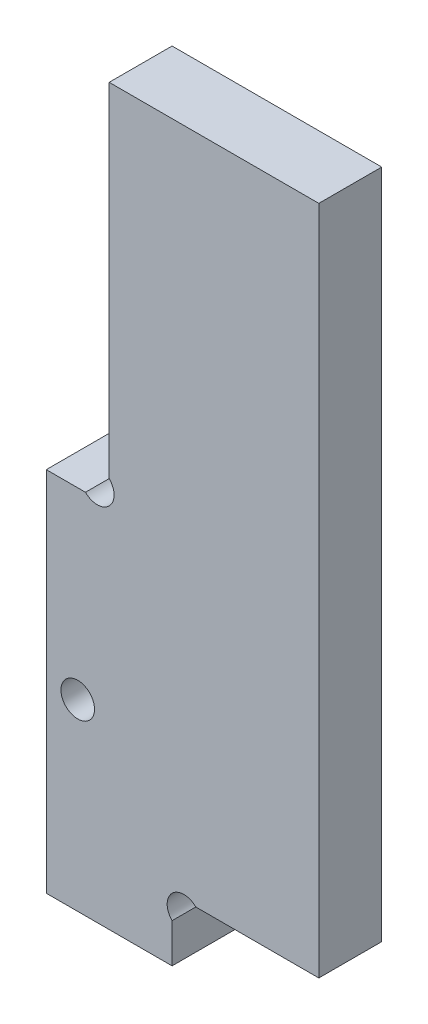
ISO-10303-21;
HEADER;
FILE_DESCRIPTION(('STEP AP214'),'2;1');
FILE_NAME('part.step','',(''),(''),'','','');
FILE_SCHEMA(('AUTOMOTIVE_DESIGN { 1 0 10303 214 1 1 1 1 }'));
ENDSEC;
DATA;
#1=APPLICATION_CONTEXT('core data for automotive mechanical design processes');
#2=APPLICATION_PROTOCOL_DEFINITION('international standard','automotive_design',2000,#1);
#3=PRODUCT_CONTEXT('',#1,'mechanical');
#4=PRODUCT('Part','Part','',(#3));
#5=PRODUCT_RELATED_PRODUCT_CATEGORY('part','',(#4));
#6=PRODUCT_DEFINITION_FORMATION('','',#4);
#7=PRODUCT_DEFINITION_CONTEXT('part definition',#1,'design');
#8=PRODUCT_DEFINITION('design','',#6,#7);
#9=PRODUCT_DEFINITION_SHAPE('','',#8);
#10=(LENGTH_UNIT() NAMED_UNIT(*) SI_UNIT(.MILLI.,.METRE.));
#11=(NAMED_UNIT(*) PLANE_ANGLE_UNIT() SI_UNIT($,.RADIAN.));
#12=(NAMED_UNIT(*) SI_UNIT($,.STERADIAN.) SOLID_ANGLE_UNIT());
#13=UNCERTAINTY_MEASURE_WITH_UNIT(LENGTH_MEASURE(1.E-05),#10,'distance_accuracy_value','');
#14=(GEOMETRIC_REPRESENTATION_CONTEXT(3) GLOBAL_UNCERTAINTY_ASSIGNED_CONTEXT((#13)) GLOBAL_UNIT_ASSIGNED_CONTEXT((#10,
#11,#12)) REPRESENTATION_CONTEXT('',''));
#15=CARTESIAN_POINT('',(0.,0.,0.));
#16=DIRECTION('',(0.,0.,1.));
#17=DIRECTION('',(1.,0.,0.));
#18=AXIS2_PLACEMENT_3D('',#15,#16,#17);
#19=CARTESIAN_POINT('',(13.1313708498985,4.86862915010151,6.));
#20=DIRECTION('',(0.,0.,1.));
#21=DIRECTION('',(1.,0.,0.));
#22=AXIS2_PLACEMENT_3D('',#19,#20,#21);
#23=PLANE('',#22);
#24=CARTESIAN_POINT('',(13.1313708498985,4.86862915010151,6.));
#25=DIRECTION('',(0.,0.,-1.));
#26=DIRECTION('',(1.,0.,0.));
#27=AXIS2_PLACEMENT_3D('',#24,#25,#26);
#28=CIRCLE('',#27,1.60000000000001);
#29=CARTESIAN_POINT('',(12.,3.73725830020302,6.));
#30=VERTEX_POINT('',#29);
#31=CARTESIAN_POINT('',(14.262741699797,6.,6.));
#32=VERTEX_POINT('',#31);
#33=EDGE_CURVE('E165',#30,#32,#28,.T.);
#34=ORIENTED_EDGE('',*,*,#33,.T.);
#35=DIRECTION('',(1.,0.,0.));
#36=VECTOR('',#35,1.);
#37=CARTESIAN_POINT('',(14.262741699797,6.,6.));
#38=LINE('',#37,#36);
#39=CARTESIAN_POINT('',(26.,6.,6.));
#40=VERTEX_POINT('',#39);
#41=EDGE_CURVE('E103',#32,#40,#38,.T.);
#42=ORIENTED_EDGE('',*,*,#41,.T.);
#43=DIRECTION('',(0.,1.,0.));
#44=VECTOR('',#43,1.);
#45=CARTESIAN_POINT('',(26.,6.,6.));
#46=LINE('',#45,#44);
#47=CARTESIAN_POINT('',(26.,70.,6.));
#48=VERTEX_POINT('',#47);
#49=EDGE_CURVE('E186',#40,#48,#46,.T.);
#50=ORIENTED_EDGE('',*,*,#49,.T.);
#51=DIRECTION('',(-1.,0.,0.));
#52=VECTOR('',#51,1.);
#53=CARTESIAN_POINT('',(26.,70.,6.));
#54=LINE('',#53,#52);
#55=CARTESIAN_POINT('',(6.,70.,6.));
#56=VERTEX_POINT('',#55);
#57=EDGE_CURVE('E205',#48,#56,#54,.T.);
#58=ORIENTED_EDGE('',*,*,#57,.T.);
#59=DIRECTION('',(0.,-1.,0.));
#60=VECTOR('',#59,1.);
#61=CARTESIAN_POINT('',(6.,70.,6.));
#62=LINE('',#61,#60);
#63=CARTESIAN_POINT('',(6.00000000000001,37.2627416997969,6.));
#64=VERTEX_POINT('',#63);
#65=EDGE_CURVE('E202',#56,#64,#62,.T.);
#66=ORIENTED_EDGE('',*,*,#65,.T.);
#67=CARTESIAN_POINT('',(4.86862915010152,36.1313708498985,6.));
#68=DIRECTION('',(0.,0.,-1.));
#69=DIRECTION('',(1.,0.,0.));
#70=AXIS2_PLACEMENT_3D('',#67,#68,#69);
#71=CIRCLE('',#70,1.6);
#72=CARTESIAN_POINT('',(3.73725830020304,35.,6.));
#73=VERTEX_POINT('',#72);
#74=EDGE_CURVE('E204',#64,#73,#71,.T.);
#75=ORIENTED_EDGE('',*,*,#74,.T.);
#76=DIRECTION('',(-1.,0.,0.));
#77=VECTOR('',#76,1.);
#78=CARTESIAN_POINT('',(0.,35.,6.));
#79=LINE('',#78,#77);
#80=CARTESIAN_POINT('',(0.,35.,6.));
#81=VERTEX_POINT('',#80);
#82=EDGE_CURVE('E128',#73,#81,#79,.T.);
#83=ORIENTED_EDGE('',*,*,#82,.T.);
#84=DIRECTION('',(0.,-1.,0.));
#85=VECTOR('',#84,1.);
#86=CARTESIAN_POINT('',(0.,0.,6.));
#87=LINE('',#86,#85);
#88=CARTESIAN_POINT('',(0.,0.,6.));
#89=VERTEX_POINT('',#88);
#90=EDGE_CURVE('E122',#81,#89,#87,.T.);
#91=ORIENTED_EDGE('',*,*,#90,.T.);
#92=DIRECTION('',(1.,0.,0.));
#93=VECTOR('',#92,1.);
#94=CARTESIAN_POINT('',(12.,0.,6.));
#95=LINE('',#94,#93);
#96=CARTESIAN_POINT('',(12.,0.,6.));
#97=VERTEX_POINT('',#96);
#98=EDGE_CURVE('E126',#89,#97,#95,.T.);
#99=ORIENTED_EDGE('',*,*,#98,.T.);
#100=DIRECTION('',(0.,1.,0.));
#101=VECTOR('',#100,1.);
#102=CARTESIAN_POINT('',(12.,3.73725830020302,6.));
#103=LINE('',#102,#101);
#104=EDGE_CURVE('E54',#97,#30,#103,.T.);
#105=ORIENTED_EDGE('',*,*,#104,.T.);
#106=EDGE_LOOP('',(#34,#42,#50,#58,#66,#75,#83,#91,#99,#105));
#107=FACE_BOUND('',#106,.T.);
#108=CARTESIAN_POINT('',(3.,17.5,6.));
#109=DIRECTION('',(0.,0.,1.));
#110=DIRECTION('',(1.,0.,0.));
#111=AXIS2_PLACEMENT_3D('',#108,#109,#110);
#112=CIRCLE('',#111,1.6);
#113=CARTESIAN_POINT('',(4.6,17.5,6.));
#114=VERTEX_POINT('',#113);
#115=EDGE_CURVE('E150',#114,#114,#112,.T.);
#116=ORIENTED_EDGE('',*,*,#115,.F.);
#117=EDGE_LOOP('',(#116));
#118=FACE_BOUND('',#117,.T.);
#119=ADVANCED_FACE('F37',(#107,#118),#23,.T.);
#120=CARTESIAN_POINT('',(13.1313708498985,4.86862915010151,0.));
#121=DIRECTION('',(0.,0.,1.));
#122=DIRECTION('',(1.,0.,0.));
#123=AXIS2_PLACEMENT_3D('',#120,#121,#122);
#124=PLANE('',#123);
#125=CARTESIAN_POINT('',(13.1313708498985,4.86862915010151,0.));
#126=DIRECTION('',(0.,0.,-1.));
#127=DIRECTION('',(1.,0.,0.));
#128=AXIS2_PLACEMENT_3D('',#125,#126,#127);
#129=CIRCLE('',#128,1.60000000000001);
#130=CARTESIAN_POINT('',(12.,3.73725830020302,0.));
#131=VERTEX_POINT('',#130);
#132=CARTESIAN_POINT('',(14.262741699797,6.,0.));
#133=VERTEX_POINT('',#132);
#134=EDGE_CURVE('E146',#131,#133,#129,.T.);
#135=ORIENTED_EDGE('',*,*,#134,.F.);
#136=DIRECTION('',(0.,1.,0.));
#137=VECTOR('',#136,1.);
#138=CARTESIAN_POINT('',(12.,3.73725830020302,0.));
#139=LINE('',#138,#137);
#140=CARTESIAN_POINT('',(12.,0.,0.));
#141=VERTEX_POINT('',#140);
#142=EDGE_CURVE('E95',#141,#131,#139,.T.);
#143=ORIENTED_EDGE('',*,*,#142,.F.);
#144=DIRECTION('',(1.,0.,0.));
#145=VECTOR('',#144,1.);
#146=CARTESIAN_POINT('',(12.,0.,0.));
#147=LINE('',#146,#145);
#148=CARTESIAN_POINT('',(0.,0.,0.));
#149=VERTEX_POINT('',#148);
#150=EDGE_CURVE('E89',#149,#141,#147,.T.);
#151=ORIENTED_EDGE('',*,*,#150,.F.);
#152=DIRECTION('',(0.,-1.,0.));
#153=VECTOR('',#152,1.);
#154=CARTESIAN_POINT('',(0.,0.,0.));
#155=LINE('',#154,#153);
#156=CARTESIAN_POINT('',(0.,35.,0.));
#157=VERTEX_POINT('',#156);
#158=EDGE_CURVE('E136',#157,#149,#155,.T.);
#159=ORIENTED_EDGE('',*,*,#158,.F.);
#160=DIRECTION('',(-1.,0.,0.));
#161=VECTOR('',#160,1.);
#162=CARTESIAN_POINT('',(0.,35.,0.));
#163=LINE('',#162,#161);
#164=CARTESIAN_POINT('',(3.73725830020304,35.,0.));
#165=VERTEX_POINT('',#164);
#166=EDGE_CURVE('E160',#165,#157,#163,.T.);
#167=ORIENTED_EDGE('',*,*,#166,.F.);
#168=CARTESIAN_POINT('',(4.86862915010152,36.1313708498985,0.));
#169=DIRECTION('',(0.,0.,-1.));
#170=DIRECTION('',(1.,0.,0.));
#171=AXIS2_PLACEMENT_3D('',#168,#169,#170);
#172=CIRCLE('',#171,1.6);
#173=CARTESIAN_POINT('',(6.00000000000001,37.2627416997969,0.));
#174=VERTEX_POINT('',#173);
#175=EDGE_CURVE('E158',#174,#165,#172,.T.);
#176=ORIENTED_EDGE('',*,*,#175,.F.);
#177=DIRECTION('',(0.,-1.,0.));
#178=VECTOR('',#177,1.);
#179=CARTESIAN_POINT('',(6.,70.,0.));
#180=LINE('',#179,#178);
#181=CARTESIAN_POINT('',(6.,70.,0.));
#182=VERTEX_POINT('',#181);
#183=EDGE_CURVE('E156',#182,#174,#180,.T.);
#184=ORIENTED_EDGE('',*,*,#183,.F.);
#185=DIRECTION('',(-1.,0.,0.));
#186=VECTOR('',#185,1.);
#187=CARTESIAN_POINT('',(26.,70.,0.));
#188=LINE('',#187,#186);
#189=CARTESIAN_POINT('',(26.,70.,0.));
#190=VERTEX_POINT('',#189);
#191=EDGE_CURVE('E154',#190,#182,#188,.T.);
#192=ORIENTED_EDGE('',*,*,#191,.F.);
#193=DIRECTION('',(0.,1.,0.));
#194=VECTOR('',#193,1.);
#195=CARTESIAN_POINT('',(26.,6.,0.));
#196=LINE('',#195,#194);
#197=CARTESIAN_POINT('',(26.,6.,0.));
#198=VERTEX_POINT('',#197);
#199=EDGE_CURVE('E152',#198,#190,#196,.T.);
#200=ORIENTED_EDGE('',*,*,#199,.F.);
#201=DIRECTION('',(1.,0.,0.));
#202=VECTOR('',#201,1.);
#203=CARTESIAN_POINT('',(14.262741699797,6.,0.));
#204=LINE('',#203,#202);
#205=EDGE_CURVE('E149',#133,#198,#204,.T.);
#206=ORIENTED_EDGE('',*,*,#205,.F.);
#207=EDGE_LOOP('',(#135,#143,#151,#159,#167,#176,#184,#192,#200,#206));
#208=FACE_BOUND('',#207,.T.);
#209=CARTESIAN_POINT('',(3.,17.5,0.));
#210=DIRECTION('',(0.,0.,1.));
#211=DIRECTION('',(1.,0.,0.));
#212=AXIS2_PLACEMENT_3D('',#209,#210,#211);
#213=CIRCLE('',#212,1.6);
#214=CARTESIAN_POINT('',(4.6,17.5,0.));
#215=VERTEX_POINT('',#214);
#216=EDGE_CURVE('E213',#215,#215,#213,.T.);
#217=ORIENTED_EDGE('',*,*,#216,.T.);
#218=EDGE_LOOP('',(#217));
#219=FACE_BOUND('',#218,.T.);
#220=ADVANCED_FACE('F190',(#208,#219),#124,.F.);
#221=CARTESIAN_POINT('',(13.1313708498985,4.86862915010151,6.));
#222=DIRECTION('',(0.,0.,-1.));
#223=DIRECTION('',(-1.,0.,0.));
#224=AXIS2_PLACEMENT_3D('',#221,#222,#223);
#225=CYLINDRICAL_SURFACE('',#224,1.60000000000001);
#226=ORIENTED_EDGE('',*,*,#134,.T.);
#227=DIRECTION('',(0.,0.,-1.));
#228=VECTOR('',#227,1.);
#229=CARTESIAN_POINT('',(14.262741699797,6.,6.));
#230=LINE('',#229,#228);
#231=EDGE_CURVE('E11',#32,#133,#230,.T.);
#232=ORIENTED_EDGE('',*,*,#231,.F.);
#233=ORIENTED_EDGE('',*,*,#33,.F.);
#234=DIRECTION('',(0.,0.,-1.));
#235=VECTOR('',#234,1.);
#236=CARTESIAN_POINT('',(12.,3.73725830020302,6.));
#237=LINE('',#236,#235);
#238=EDGE_CURVE('E142',#30,#131,#237,.T.);
#239=ORIENTED_EDGE('',*,*,#238,.T.);
#240=EDGE_LOOP('',(#226,#232,#233,#239));
#241=FACE_BOUND('',#240,.T.);
#242=ADVANCED_FACE('F39',(#241),#225,.F.);
#243=CARTESIAN_POINT('',(14.262741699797,6.,6.));
#244=DIRECTION('',(0.,1.,0.));
#245=DIRECTION('',(-1.,0.,0.));
#246=AXIS2_PLACEMENT_3D('',#243,#244,#245);
#247=PLANE('',#246);
#248=ORIENTED_EDGE('',*,*,#205,.T.);
#249=DIRECTION('',(0.,0.,-1.));
#250=VECTOR('',#249,1.);
#251=CARTESIAN_POINT('',(26.,6.,6.));
#252=LINE('',#251,#250);
#253=EDGE_CURVE('E46',#40,#198,#252,.T.);
#254=ORIENTED_EDGE('',*,*,#253,.F.);
#255=ORIENTED_EDGE('',*,*,#41,.F.);
#256=ORIENTED_EDGE('',*,*,#231,.T.);
#257=EDGE_LOOP('',(#248,#254,#255,#256));
#258=FACE_BOUND('',#257,.T.);
#259=ADVANCED_FACE('F249',(#258),#247,.F.);
#260=CARTESIAN_POINT('',(26.,6.,6.));
#261=DIRECTION('',(-1.,0.,0.));
#262=DIRECTION('',(0.,-1.,0.));
#263=AXIS2_PLACEMENT_3D('',#260,#261,#262);
#264=PLANE('',#263);
#265=ORIENTED_EDGE('',*,*,#199,.T.);
#266=DIRECTION('',(0.,0.,-1.));
#267=VECTOR('',#266,1.);
#268=CARTESIAN_POINT('',(26.,70.,6.));
#269=LINE('',#268,#267);
#270=EDGE_CURVE('E178',#48,#190,#269,.T.);
#271=ORIENTED_EDGE('',*,*,#270,.F.);
#272=ORIENTED_EDGE('',*,*,#49,.F.);
#273=ORIENTED_EDGE('',*,*,#253,.T.);
#274=EDGE_LOOP('',(#265,#271,#272,#273));
#275=FACE_BOUND('',#274,.T.);
#276=ADVANCED_FACE('F184',(#275),#264,.F.);
#277=CARTESIAN_POINT('',(26.,70.,6.));
#278=DIRECTION('',(0.,-1.,0.));
#279=DIRECTION('',(0.,0.,-1.));
#280=AXIS2_PLACEMENT_3D('',#277,#278,#279);
#281=PLANE('',#280);
#282=ORIENTED_EDGE('',*,*,#191,.T.);
#283=DIRECTION('',(0.,0.,-1.));
#284=VECTOR('',#283,1.);
#285=CARTESIAN_POINT('',(6.,70.,6.));
#286=LINE('',#285,#284);
#287=EDGE_CURVE('E175',#56,#182,#286,.T.);
#288=ORIENTED_EDGE('',*,*,#287,.F.);
#289=ORIENTED_EDGE('',*,*,#57,.F.);
#290=ORIENTED_EDGE('',*,*,#270,.T.);
#291=EDGE_LOOP('',(#282,#288,#289,#290));
#292=FACE_BOUND('',#291,.T.);
#293=ADVANCED_FACE('F196',(#292),#281,.F.);
#294=CARTESIAN_POINT('',(6.,70.,6.));
#295=DIRECTION('',(1.,0.,0.));
#296=DIRECTION('',(0.,1.,0.));
#297=AXIS2_PLACEMENT_3D('',#294,#295,#296);
#298=PLANE('',#297);
#299=ORIENTED_EDGE('',*,*,#183,.T.);
#300=DIRECTION('',(0.,0.,-1.));
#301=VECTOR('',#300,1.);
#302=CARTESIAN_POINT('',(6.00000000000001,37.2627416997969,6.));
#303=LINE('',#302,#301);
#304=EDGE_CURVE('E172',#64,#174,#303,.T.);
#305=ORIENTED_EDGE('',*,*,#304,.F.);
#306=ORIENTED_EDGE('',*,*,#65,.F.);
#307=ORIENTED_EDGE('',*,*,#287,.T.);
#308=EDGE_LOOP('',(#299,#305,#306,#307));
#309=FACE_BOUND('',#308,.T.);
#310=ADVANCED_FACE('F200',(#309),#298,.F.);
#311=CARTESIAN_POINT('',(4.86862915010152,36.1313708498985,6.));
#312=DIRECTION('',(0.,0.,-1.));
#313=DIRECTION('',(-1.,0.,0.));
#314=AXIS2_PLACEMENT_3D('',#311,#312,#313);
#315=CYLINDRICAL_SURFACE('',#314,1.6);
#316=ORIENTED_EDGE('',*,*,#175,.T.);
#317=DIRECTION('',(0.,0.,-1.));
#318=VECTOR('',#317,1.);
#319=CARTESIAN_POINT('',(3.73725830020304,35.,6.));
#320=LINE('',#319,#318);
#321=EDGE_CURVE('E169',#73,#165,#320,.T.);
#322=ORIENTED_EDGE('',*,*,#321,.F.);
#323=ORIENTED_EDGE('',*,*,#74,.F.);
#324=ORIENTED_EDGE('',*,*,#304,.T.);
#325=EDGE_LOOP('',(#316,#322,#323,#324));
#326=FACE_BOUND('',#325,.T.);
#327=ADVANCED_FACE('F239',(#326),#315,.F.);
#328=CARTESIAN_POINT('',(0.,35.,6.));
#329=DIRECTION('',(0.,-1.,0.));
#330=DIRECTION('',(1.,0.,0.));
#331=AXIS2_PLACEMENT_3D('',#328,#329,#330);
#332=PLANE('',#331);
#333=ORIENTED_EDGE('',*,*,#166,.T.);
#334=DIRECTION('',(0.,0.,-1.));
#335=VECTOR('',#334,1.);
#336=CARTESIAN_POINT('',(0.,35.,6.));
#337=LINE('',#336,#335);
#338=EDGE_CURVE('E137',#81,#157,#337,.T.);
#339=ORIENTED_EDGE('',*,*,#338,.F.);
#340=ORIENTED_EDGE('',*,*,#82,.F.);
#341=ORIENTED_EDGE('',*,*,#321,.T.);
#342=EDGE_LOOP('',(#333,#339,#340,#341));
#343=FACE_BOUND('',#342,.T.);
#344=ADVANCED_FACE('F236',(#343),#332,.F.);
#345=CARTESIAN_POINT('',(0.,0.,6.));
#346=DIRECTION('',(1.,0.,0.));
#347=DIRECTION('',(0.,0.,-1.));
#348=AXIS2_PLACEMENT_3D('',#345,#346,#347);
#349=PLANE('',#348);
#350=ORIENTED_EDGE('',*,*,#158,.T.);
#351=DIRECTION('',(0.,0.,-1.));
#352=VECTOR('',#351,1.);
#353=CARTESIAN_POINT('',(0.,0.,6.));
#354=LINE('',#353,#352);
#355=EDGE_CURVE('E133',#89,#149,#354,.T.);
#356=ORIENTED_EDGE('',*,*,#355,.F.);
#357=ORIENTED_EDGE('',*,*,#90,.F.);
#358=ORIENTED_EDGE('',*,*,#338,.T.);
#359=EDGE_LOOP('',(#350,#356,#357,#358));
#360=FACE_BOUND('',#359,.T.);
#361=ADVANCED_FACE('F134',(#360),#349,.F.);
#362=CARTESIAN_POINT('',(12.,0.,6.));
#363=DIRECTION('',(0.,1.,0.));
#364=DIRECTION('',(0.,0.,1.));
#365=AXIS2_PLACEMENT_3D('',#362,#363,#364);
#366=PLANE('',#365);
#367=ORIENTED_EDGE('',*,*,#150,.T.);
#368=DIRECTION('',(0.,0.,-1.));
#369=VECTOR('',#368,1.);
#370=CARTESIAN_POINT('',(12.,0.,6.));
#371=LINE('',#370,#369);
#372=EDGE_CURVE('E138',#97,#141,#371,.T.);
#373=ORIENTED_EDGE('',*,*,#372,.F.);
#374=ORIENTED_EDGE('',*,*,#98,.F.);
#375=ORIENTED_EDGE('',*,*,#355,.T.);
#376=EDGE_LOOP('',(#367,#373,#374,#375));
#377=FACE_BOUND('',#376,.T.);
#378=ADVANCED_FACE('F140',(#377),#366,.F.);
#379=CARTESIAN_POINT('',(12.,3.73725830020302,6.));
#380=DIRECTION('',(-1.,0.,0.));
#381=DIRECTION('',(0.,0.,1.));
#382=AXIS2_PLACEMENT_3D('',#379,#380,#381);
#383=PLANE('',#382);
#384=ORIENTED_EDGE('',*,*,#142,.T.);
#385=ORIENTED_EDGE('',*,*,#238,.F.);
#386=ORIENTED_EDGE('',*,*,#104,.F.);
#387=ORIENTED_EDGE('',*,*,#372,.T.);
#388=EDGE_LOOP('',(#384,#385,#386,#387));
#389=FACE_BOUND('',#388,.T.);
#390=ADVANCED_FACE('F229',(#389),#383,.F.);
#391=CARTESIAN_POINT('',(3.,17.5,6.));
#392=DIRECTION('',(0.,0.,-1.));
#393=DIRECTION('',(-1.,0.,0.));
#394=AXIS2_PLACEMENT_3D('',#391,#392,#393);
#395=CYLINDRICAL_SURFACE('',#394,1.6);
#396=ORIENTED_EDGE('',*,*,#115,.T.);
#397=EDGE_LOOP('',(#396));
#398=FACE_BOUND('',#397,.T.);
#399=ORIENTED_EDGE('',*,*,#216,.F.);
#400=EDGE_LOOP('',(#399));
#401=FACE_BOUND('',#400,.T.);
#402=ADVANCED_FACE('F219',(#398,#401),#395,.F.);
#403=CLOSED_SHELL('',(#119,#220,#242,#259,#276,#293,#310,#327,#344,#361,#378,#390,#402));
#404=MANIFOLD_SOLID_BREP('B2',#403);
#405=ADVANCED_BREP_SHAPE_REPRESENTATION('',(#18,#404),#14);
#406=SHAPE_DEFINITION_REPRESENTATION(#9,#405);
ENDSEC;
END-ISO-10303-21;
